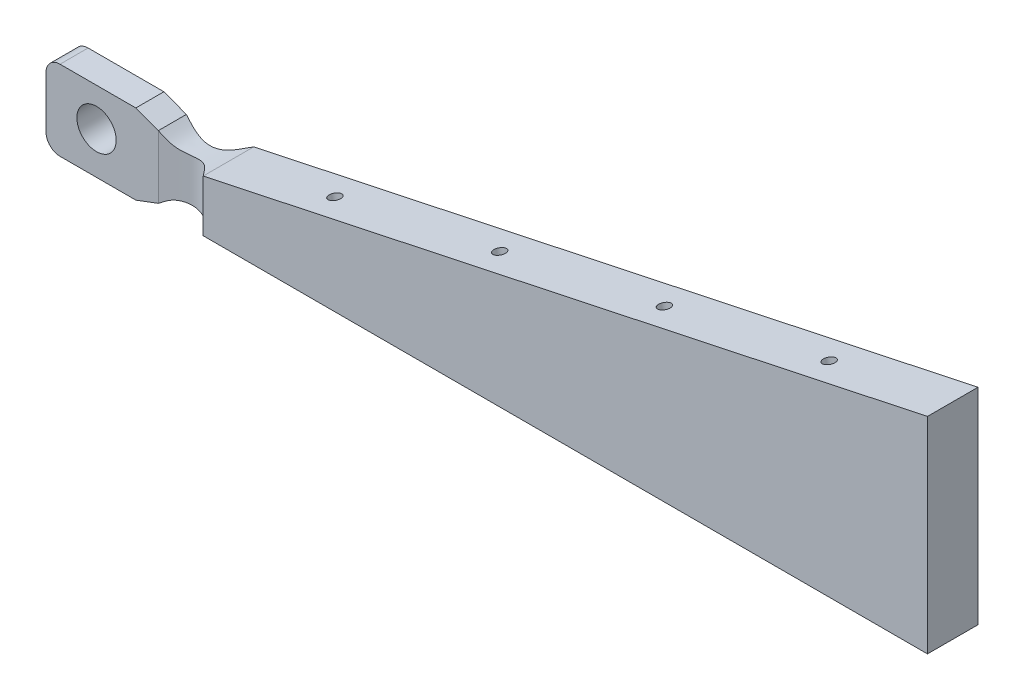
ISO-10303-21;
HEADER;
FILE_DESCRIPTION(('STEP AP214'),'2;1');
FILE_NAME('part.step','',(''),(''),'','','');
FILE_SCHEMA(('AUTOMOTIVE_DESIGN { 1 0 10303 214 1 1 1 1 }'));
ENDSEC;
DATA;
#1=APPLICATION_CONTEXT('core data for automotive mechanical design processes');
#2=APPLICATION_PROTOCOL_DEFINITION('international standard','automotive_design',2000,#1);
#3=PRODUCT_CONTEXT('',#1,'mechanical');
#4=PRODUCT('Part','Part','',(#3));
#5=PRODUCT_RELATED_PRODUCT_CATEGORY('part','',(#4));
#6=PRODUCT_DEFINITION_FORMATION('','',#4);
#7=PRODUCT_DEFINITION_CONTEXT('part definition',#1,'design');
#8=PRODUCT_DEFINITION('design','',#6,#7);
#9=PRODUCT_DEFINITION_SHAPE('','',#8);
#10=(LENGTH_UNIT() NAMED_UNIT(*) SI_UNIT(.MILLI.,.METRE.));
#11=(NAMED_UNIT(*) PLANE_ANGLE_UNIT() SI_UNIT($,.RADIAN.));
#12=(NAMED_UNIT(*) SI_UNIT($,.STERADIAN.) SOLID_ANGLE_UNIT());
#13=UNCERTAINTY_MEASURE_WITH_UNIT(LENGTH_MEASURE(1.E-05),#10,'distance_accuracy_value','');
#14=(GEOMETRIC_REPRESENTATION_CONTEXT(3) GLOBAL_UNCERTAINTY_ASSIGNED_CONTEXT((#13)) GLOBAL_UNIT_ASSIGNED_CONTEXT((#10,
#11,#12)) REPRESENTATION_CONTEXT('',''));
#15=CARTESIAN_POINT('',(0.,0.,0.));
#16=DIRECTION('',(0.,0.,1.));
#17=DIRECTION('',(1.,0.,0.));
#18=AXIS2_PLACEMENT_3D('',#15,#16,#17);
#19=CARTESIAN_POINT('',(-129.,0.,9.));
#20=DIRECTION('',(0.,1.,0.));
#21=DIRECTION('',(0.,0.,1.));
#22=AXIS2_PLACEMENT_3D('',#19,#20,#21);
#23=PLANE('',#22);
#24=CARTESIAN_POINT('',(-91.,0.,0.));
#25=DIRECTION('',(0.,-1.,0.));
#26=DIRECTION('',(0.,0.,-1.));
#27=AXIS2_PLACEMENT_3D('',#24,#25,#26);
#28=CIRCLE('',#27,2.09999999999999);
#29=CARTESIAN_POINT('',(-91.,0.,-2.09999999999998));
#30=VERTEX_POINT('',#29);
#31=EDGE_CURVE('E172',#30,#30,#28,.T.);
#32=ORIENTED_EDGE('',*,*,#31,.F.);
#33=EDGE_LOOP('',(#32));
#34=FACE_BOUND('',#33,.T.);
#35=CARTESIAN_POINT('',(-31.,0.,0.));
#36=DIRECTION('',(0.,-1.,0.));
#37=DIRECTION('',(0.,0.,-1.));
#38=AXIS2_PLACEMENT_3D('',#35,#36,#37);
#39=CIRCLE('',#38,2.09999999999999);
#40=CARTESIAN_POINT('',(-31.,0.,-2.09999999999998));
#41=VERTEX_POINT('',#40);
#42=EDGE_CURVE('E189',#41,#41,#39,.T.);
#43=ORIENTED_EDGE('',*,*,#42,.F.);
#44=EDGE_LOOP('',(#43));
#45=FACE_BOUND('',#44,.T.);
#46=CARTESIAN_POINT('',(29.,0.,0.));
#47=DIRECTION('',(0.,-1.,0.));
#48=DIRECTION('',(0.,0.,-1.));
#49=AXIS2_PLACEMENT_3D('',#46,#47,#48);
#50=CIRCLE('',#49,2.09999999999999);
#51=CARTESIAN_POINT('',(29.,0.,-2.09999999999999));
#52=VERTEX_POINT('',#51);
#53=EDGE_CURVE('E195',#52,#52,#50,.T.);
#54=ORIENTED_EDGE('',*,*,#53,.F.);
#55=EDGE_LOOP('',(#54));
#56=FACE_BOUND('',#55,.T.);
#57=CARTESIAN_POINT('',(89.,0.,0.));
#58=DIRECTION('',(0.,-1.,0.));
#59=DIRECTION('',(0.,0.,-1.));
#60=AXIS2_PLACEMENT_3D('',#57,#58,#59);
#61=CIRCLE('',#60,2.09999999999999);
#62=CARTESIAN_POINT('',(89.,0.,-2.09999999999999));
#63=VERTEX_POINT('',#62);
#64=EDGE_CURVE('E201',#63,#63,#61,.T.);
#65=ORIENTED_EDGE('',*,*,#64,.F.);
#66=EDGE_LOOP('',(#65));
#67=FACE_BOUND('',#66,.T.);
#68=DIRECTION('',(1.,0.,0.));
#69=VECTOR('',#68,1.);
#70=CARTESIAN_POINT('',(-129.,0.,-9.));
#71=LINE('',#70,#69);
#72=CARTESIAN_POINT('',(-129.,0.,-9.));
#73=VERTEX_POINT('',#72);
#74=CARTESIAN_POINT('',(129.,0.,-9.));
#75=VERTEX_POINT('',#74);
#76=EDGE_CURVE('E325',#73,#75,#71,.T.);
#77=ORIENTED_EDGE('',*,*,#76,.T.);
#78=DIRECTION('',(0.,0.,-1.));
#79=VECTOR('',#78,1.);
#80=CARTESIAN_POINT('',(129.,0.,9.));
#81=LINE('',#80,#79);
#82=CARTESIAN_POINT('',(129.,0.,9.));
#83=VERTEX_POINT('',#82);
#84=EDGE_CURVE('E345',#83,#75,#81,.T.);
#85=ORIENTED_EDGE('',*,*,#84,.F.);
#86=DIRECTION('',(1.,0.,0.));
#87=VECTOR('',#86,1.);
#88=CARTESIAN_POINT('',(-129.,0.,9.));
#89=LINE('',#88,#87);
#90=CARTESIAN_POINT('',(-129.,0.,9.));
#91=VERTEX_POINT('',#90);
#92=EDGE_CURVE('E334',#91,#83,#89,.T.);
#93=ORIENTED_EDGE('',*,*,#92,.F.);
#94=DIRECTION('',(0.,0.,-1.));
#95=VECTOR('',#94,1.);
#96=CARTESIAN_POINT('',(-129.,0.,9.));
#97=LINE('',#96,#95);
#98=EDGE_CURVE('E348',#91,#73,#97,.T.);
#99=ORIENTED_EDGE('',*,*,#98,.T.);
#100=EDGE_LOOP('',(#77,#85,#93,#99));
#101=FACE_BOUND('',#100,.T.);
#102=ADVANCED_FACE('F36',(#34,#45,#56,#67,#101),#23,.F.);
#103=CARTESIAN_POINT('',(129.,0.,9.));
#104=DIRECTION('',(-1.,0.,0.));
#105=DIRECTION('',(0.,0.,1.));
#106=AXIS2_PLACEMENT_3D('',#103,#104,#105);
#107=PLANE('',#106);
#108=DIRECTION('',(0.,1.,0.));
#109=VECTOR('',#108,1.);
#110=CARTESIAN_POINT('',(129.,0.,-9.));
#111=LINE('',#110,#109);
#112=CARTESIAN_POINT('',(129.,73.2753393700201,-9.));
#113=VERTEX_POINT('',#112);
#114=EDGE_CURVE('E327',#75,#113,#111,.T.);
#115=ORIENTED_EDGE('',*,*,#114,.T.);
#116=DIRECTION('',(0.,0.,-1.));
#117=VECTOR('',#116,1.);
#118=CARTESIAN_POINT('',(129.,73.2753393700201,9.));
#119=LINE('',#118,#117);
#120=CARTESIAN_POINT('',(129.,73.2753393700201,9.));
#121=VERTEX_POINT('',#120);
#122=EDGE_CURVE('E342',#121,#113,#119,.T.);
#123=ORIENTED_EDGE('',*,*,#122,.F.);
#124=DIRECTION('',(0.,1.,0.));
#125=VECTOR('',#124,1.);
#126=CARTESIAN_POINT('',(129.,0.,9.));
#127=LINE('',#126,#125);
#128=EDGE_CURVE('E336',#83,#121,#127,.T.);
#129=ORIENTED_EDGE('',*,*,#128,.F.);
#130=ORIENTED_EDGE('',*,*,#84,.T.);
#131=EDGE_LOOP('',(#115,#123,#129,#130));
#132=FACE_BOUND('',#131,.T.);
#133=ADVANCED_FACE('F393',(#132),#107,.F.);
#134=CARTESIAN_POINT('',(129.,73.2753393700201,9.));
#135=DIRECTION('',(0.207911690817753,-0.978147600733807,0.));
#136=DIRECTION('',(0.978147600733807,0.207911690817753,0.));
#137=AXIS2_PLACEMENT_3D('',#134,#135,#136);
#138=PLANE('',#137);
#139=CARTESIAN_POINT('',(-91.0832101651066,26.4952089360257,0.));
#140=DIRECTION('',(-0.207911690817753,0.978147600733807,0.));
#141=DIRECTION('',(-0.978147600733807,-0.207911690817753,0.));
#142=AXIS2_PLACEMENT_3D('',#139,#140,#141);
#143=CIRCLE('',#142,2.09999999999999);
#144=CARTESIAN_POINT('',(-93.1373201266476,26.0585943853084,0.));
#145=VERTEX_POINT('',#144);
#146=EDGE_CURVE('E205',#145,#145,#143,.T.);
#147=ORIENTED_EDGE('',*,*,#146,.F.);
#148=EDGE_LOOP('',(#147));
#149=FACE_BOUND('',#148,.T.);
#150=CARTESIAN_POINT('',(-32.3943541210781,38.9699103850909,0.));
#151=DIRECTION('',(-0.207911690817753,0.978147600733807,0.));
#152=DIRECTION('',(-0.978147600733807,-0.207911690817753,0.));
#153=AXIS2_PLACEMENT_3D('',#150,#151,#152);
#154=CIRCLE('',#153,2.09999999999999);
#155=CARTESIAN_POINT('',(-34.4484640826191,38.5332958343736,0.));
#156=VERTEX_POINT('',#155);
#157=EDGE_CURVE('E211',#156,#156,#154,.T.);
#158=ORIENTED_EDGE('',*,*,#157,.F.);
#159=EDGE_LOOP('',(#158));
#160=FACE_BOUND('',#159,.T.);
#161=CARTESIAN_POINT('',(26.2945019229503,51.4446118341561,0.));
#162=DIRECTION('',(-0.207911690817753,0.978147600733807,0.));
#163=DIRECTION('',(-0.978147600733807,-0.207911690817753,0.));
#164=AXIS2_PLACEMENT_3D('',#161,#162,#163);
#165=CIRCLE('',#164,2.09999999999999);
#166=CARTESIAN_POINT('',(24.2403919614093,51.0079972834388,0.));
#167=VERTEX_POINT('',#166);
#168=EDGE_CURVE('E217',#167,#167,#165,.T.);
#169=ORIENTED_EDGE('',*,*,#168,.F.);
#170=EDGE_LOOP('',(#169));
#171=FACE_BOUND('',#170,.T.);
#172=CARTESIAN_POINT('',(84.9833579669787,63.9193132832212,0.));
#173=DIRECTION('',(-0.207911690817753,0.978147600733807,0.));
#174=DIRECTION('',(-0.978147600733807,-0.207911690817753,0.));
#175=AXIS2_PLACEMENT_3D('',#172,#173,#174);
#176=CIRCLE('',#175,2.09999999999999);
#177=CARTESIAN_POINT('',(82.9292480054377,63.4826987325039,0.));
#178=VERTEX_POINT('',#177);
#179=EDGE_CURVE('E223',#178,#178,#176,.T.);
#180=ORIENTED_EDGE('',*,*,#179,.F.);
#181=EDGE_LOOP('',(#180));
#182=FACE_BOUND('',#181,.T.);
#183=DIRECTION('',(-0.978147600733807,-0.207911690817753,0.));
#184=VECTOR('',#183,1.);
#185=CARTESIAN_POINT('',(129.,73.2753393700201,-9.));
#186=LINE('',#185,#184);
#187=CARTESIAN_POINT('',(-129.,18.4357464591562,-9.));
#188=VERTEX_POINT('',#187);
#189=EDGE_CURVE('E329',#113,#188,#186,.T.);
#190=ORIENTED_EDGE('',*,*,#189,.T.);
#191=DIRECTION('',(0.,0.,-1.));
#192=VECTOR('',#191,1.);
#193=CARTESIAN_POINT('',(-129.,18.4357464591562,9.));
#194=LINE('',#193,#192);
#195=CARTESIAN_POINT('',(-129.,18.4357464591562,9.));
#196=VERTEX_POINT('',#195);
#197=EDGE_CURVE('E339',#196,#188,#194,.T.);
#198=ORIENTED_EDGE('',*,*,#197,.F.);
#199=DIRECTION('',(-0.978147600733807,-0.207911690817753,0.));
#200=VECTOR('',#199,1.);
#201=CARTESIAN_POINT('',(129.,73.2753393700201,9.));
#202=LINE('',#201,#200);
#203=EDGE_CURVE('E63',#121,#196,#202,.T.);
#204=ORIENTED_EDGE('',*,*,#203,.F.);
#205=ORIENTED_EDGE('',*,*,#122,.T.);
#206=EDGE_LOOP('',(#190,#198,#204,#205));
#207=FACE_BOUND('',#206,.T.);
#208=ADVANCED_FACE('F398',(#149,#160,#171,#182,#207),#138,.F.);
#209=CARTESIAN_POINT('',(-129.,0.,9.));
#210=DIRECTION('',(0.,0.,1.));
#211=DIRECTION('',(1.,0.,0.));
#212=AXIS2_PLACEMENT_3D('',#209,#210,#211);
#213=PLANE('',#212);
#214=DIRECTION('',(0.,-1.,0.));
#215=VECTOR('',#214,1.);
#216=CARTESIAN_POINT('',(-129.,18.4357464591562,9.));
#217=LINE('',#216,#215);
#218=EDGE_CURVE('E332',#196,#91,#217,.T.);
#219=ORIENTED_EDGE('',*,*,#218,.T.);
#220=ORIENTED_EDGE('',*,*,#92,.T.);
#221=ORIENTED_EDGE('',*,*,#128,.T.);
#222=ORIENTED_EDGE('',*,*,#203,.T.);
#223=EDGE_LOOP('',(#219,#220,#221,#222));
#224=FACE_BOUND('',#223,.T.);
#225=ADVANCED_FACE('F466',(#224),#213,.T.);
#226=CARTESIAN_POINT('',(-129.,0.,-9.));
#227=DIRECTION('',(0.,0.,1.));
#228=DIRECTION('',(1.,0.,0.));
#229=AXIS2_PLACEMENT_3D('',#226,#227,#228);
#230=PLANE('',#229);
#231=DIRECTION('',(0.,-1.,0.));
#232=VECTOR('',#231,1.);
#233=CARTESIAN_POINT('',(-129.,18.4357464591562,-9.));
#234=LINE('',#233,#232);
#235=EDGE_CURVE('E312',#188,#73,#234,.T.);
#236=ORIENTED_EDGE('',*,*,#235,.F.);
#237=ORIENTED_EDGE('',*,*,#189,.F.);
#238=ORIENTED_EDGE('',*,*,#114,.F.);
#239=ORIENTED_EDGE('',*,*,#76,.F.);
#240=EDGE_LOOP('',(#236,#237,#238,#239));
#241=FACE_BOUND('',#240,.T.);
#242=ADVANCED_FACE('F415',(#241),#230,.F.);
#243=CARTESIAN_POINT('',(-129.,0.,9.));
#244=CARTESIAN_POINT('',(-130.529516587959,0.325187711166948,6.99359475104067));
#245=CARTESIAN_POINT('',(-134.371844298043,1.14209794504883,1.95326596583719));
#246=CARTESIAN_POINT('',(-143.016239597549,2.44586244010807,3.82163658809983));
#247=CARTESIAN_POINT('',(-147.40743275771,-0.816741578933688,4.68638066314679));
#248=CARTESIAN_POINT('',(-149.,-2.,5.));
#249=CARTESIAN_POINT('',(-129.,18.4357464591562,9.));
#250=CARTESIAN_POINT('',(-130.529516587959,18.1105587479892,6.99359475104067));
#251=CARTESIAN_POINT('',(-134.371844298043,17.2936485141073,1.95326596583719));
#252=CARTESIAN_POINT('',(-143.016239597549,15.9898840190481,3.82163658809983));
#253=CARTESIAN_POINT('',(-147.40743275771,19.2524880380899,4.68638066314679));
#254=CARTESIAN_POINT('',(-149.,20.4357464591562,5.));
#255=B_SPLINE_SURFACE_WITH_KNOTS('',1,3,((#243,#244,#245,#246,#247,#248),(#249,#250,#251,#252,
#253,#254)),.UNSPECIFIED.,.F.,.F.,.F.,(2,2),(4,1,1,4),(0.,1.),(0.,0.296507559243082,
0.744862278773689,1.),.UNSPECIFIED.);
#256=CARTESIAN_POINT('',(-129.,18.4357464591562,9.));
#257=CARTESIAN_POINT('',(-130.529516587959,18.1105587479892,6.99359475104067));
#258=CARTESIAN_POINT('',(-134.371844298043,17.2936485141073,1.95326596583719));
#259=CARTESIAN_POINT('',(-143.016239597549,15.9898840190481,3.82163658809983));
#260=CARTESIAN_POINT('',(-147.40743275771,19.2524880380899,4.68638066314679));
#261=CARTESIAN_POINT('',(-149.,20.4357464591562,5.));
#262=B_SPLINE_CURVE_WITH_KNOTS('',3,(#256,#257,#258,#259,#260,#261),.UNSPECIFIED.,.F.,.F.,(4,1,
1,4),(0.,0.296507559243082,0.744862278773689,1.),.UNSPECIFIED.);
#263=CARTESIAN_POINT('',(-149.,20.4357464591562,5.));
#264=VERTEX_POINT('',#263);
#265=EDGE_CURVE('E304',#196,#264,#262,.T.);
#266=DIRECTION('',(0.,-1.,0.));
#267=VECTOR('',#266,1.);
#268=CARTESIAN_POINT('',(-149.,20.4357464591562,5.));
#269=LINE('',#268,#267);
#270=CARTESIAN_POINT('',(-149.,-2.,5.));
#271=VERTEX_POINT('',#270);
#272=EDGE_CURVE('E285',#264,#271,#269,.T.);
#273=CARTESIAN_POINT('',(-129.,0.,9.));
#274=CARTESIAN_POINT('',(-130.529516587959,0.325187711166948,6.99359475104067));
#275=CARTESIAN_POINT('',(-134.371844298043,1.14209794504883,1.95326596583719));
#276=CARTESIAN_POINT('',(-143.016239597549,2.44586244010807,3.82163658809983));
#277=CARTESIAN_POINT('',(-147.40743275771,-0.816741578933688,4.68638066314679));
#278=CARTESIAN_POINT('',(-149.,-2.,5.));
#279=B_SPLINE_CURVE_WITH_KNOTS('',3,(#273,#274,#275,#276,#277,#278),.UNSPECIFIED.,.F.,.F.,(4,1,
1,4),(0.,0.296507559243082,0.744862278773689,1.),.UNSPECIFIED.);
#280=EDGE_CURVE('E303',#271,#91,#279,.F.);
#281=ORIENTED_EDGE('',*,*,#218,.F.);
#282=ORIENTED_EDGE('',*,*,#265,.T.);
#283=ORIENTED_EDGE('',*,*,#272,.T.);
#284=ORIENTED_EDGE('',*,*,#280,.T.);
#285=EDGE_LOOP('',(#281,#282,#283,#284));
#286=FACE_BOUND('',#285,.T.);
#287=ADVANCED_FACE('F465',(#286),#255,.T.);
#288=CARTESIAN_POINT('',(-129.,18.4357464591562,9.));
#289=CARTESIAN_POINT('',(-130.529516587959,18.1105587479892,6.99359475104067));
#290=CARTESIAN_POINT('',(-134.371844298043,17.2936485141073,1.95326596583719));
#291=CARTESIAN_POINT('',(-143.016239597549,15.9898840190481,3.82163658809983));
#292=CARTESIAN_POINT('',(-147.40743275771,19.2524880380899,4.68638066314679));
#293=CARTESIAN_POINT('',(-149.,20.4357464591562,5.));
#294=CARTESIAN_POINT('',(-129.,18.4357464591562,-9.));
#295=CARTESIAN_POINT('',(-130.529516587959,18.1105587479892,-6.99359475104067));
#296=CARTESIAN_POINT('',(-134.371844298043,17.2936485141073,-1.95326596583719));
#297=CARTESIAN_POINT('',(-143.016239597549,15.9898840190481,-3.82163658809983));
#298=CARTESIAN_POINT('',(-147.40743275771,19.2524880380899,-4.68638066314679));
#299=CARTESIAN_POINT('',(-149.,20.4357464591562,-5.));
#300=B_SPLINE_SURFACE_WITH_KNOTS('',1,3,((#288,#289,#290,#291,#292,#293),(#294,#295,#296,#297,
#298,#299)),.UNSPECIFIED.,.F.,.F.,.F.,(2,2),(4,1,1,4),(0.,1.),(0.,0.296507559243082,
0.744862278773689,1.),.UNSPECIFIED.);
#301=CARTESIAN_POINT('',(-129.,18.4357464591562,-9.));
#302=CARTESIAN_POINT('',(-130.529516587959,18.1105587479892,-6.99359475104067));
#303=CARTESIAN_POINT('',(-134.371844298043,17.2936485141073,-1.95326596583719));
#304=CARTESIAN_POINT('',(-143.016239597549,15.9898840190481,-3.82163658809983));
#305=CARTESIAN_POINT('',(-147.40743275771,19.2524880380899,-4.68638066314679));
#306=CARTESIAN_POINT('',(-149.,20.4357464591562,-5.));
#307=B_SPLINE_CURVE_WITH_KNOTS('',3,(#301,#302,#303,#304,#305,#306),.UNSPECIFIED.,.F.,.F.,(4,1,
1,4),(0.,0.296507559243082,0.744862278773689,1.),.UNSPECIFIED.);
#308=CARTESIAN_POINT('',(-149.,20.4357464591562,-5.));
#309=VERTEX_POINT('',#308);
#310=EDGE_CURVE('E295',#188,#309,#307,.T.);
#311=DIRECTION('',(0.,0.,1.));
#312=VECTOR('',#311,1.);
#313=CARTESIAN_POINT('',(-149.,20.4357464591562,-5.));
#314=LINE('',#313,#312);
#315=EDGE_CURVE('E282',#309,#264,#314,.T.);
#316=ORIENTED_EDGE('',*,*,#197,.T.);
#317=ORIENTED_EDGE('',*,*,#310,.T.);
#318=ORIENTED_EDGE('',*,*,#315,.T.);
#319=ORIENTED_EDGE('',*,*,#265,.F.);
#320=EDGE_LOOP('',(#316,#317,#318,#319));
#321=FACE_BOUND('',#320,.T.);
#322=ADVANCED_FACE('F420',(#321),#300,.T.);
#323=CARTESIAN_POINT('',(-129.,0.,-9.));
#324=CARTESIAN_POINT('',(-130.529516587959,0.325187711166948,-6.99359475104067));
#325=CARTESIAN_POINT('',(-134.371844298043,1.14209794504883,-1.95326596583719));
#326=CARTESIAN_POINT('',(-143.016239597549,2.44586244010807,-3.82163658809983));
#327=CARTESIAN_POINT('',(-147.40743275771,-0.816741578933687,-4.68638066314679));
#328=CARTESIAN_POINT('',(-149.,-2.,-5.));
#329=CARTESIAN_POINT('',(-129.,0.,9.));
#330=CARTESIAN_POINT('',(-130.529516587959,0.325187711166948,6.99359475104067));
#331=CARTESIAN_POINT('',(-134.371844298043,1.14209794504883,1.95326596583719));
#332=CARTESIAN_POINT('',(-143.016239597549,2.44586244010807,3.82163658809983));
#333=CARTESIAN_POINT('',(-147.40743275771,-0.816741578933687,4.68638066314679));
#334=CARTESIAN_POINT('',(-149.,-2.,5.));
#335=B_SPLINE_SURFACE_WITH_KNOTS('',1,3,((#323,#324,#325,#326,#327,#328),(#329,#330,#331,#332,
#333,#334)),.UNSPECIFIED.,.F.,.F.,.F.,(2,2),(4,1,1,4),(0.,1.),(0.,0.296507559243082,
0.744862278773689,1.),.UNSPECIFIED.);
#336=DIRECTION('',(0.,0.,-1.));
#337=VECTOR('',#336,1.);
#338=CARTESIAN_POINT('',(-149.,-2.,5.));
#339=LINE('',#338,#337);
#340=CARTESIAN_POINT('',(-149.,-2.,-5.));
#341=VERTEX_POINT('',#340);
#342=EDGE_CURVE('E278',#271,#341,#339,.T.);
#343=CARTESIAN_POINT('',(-129.,0.,-9.));
#344=CARTESIAN_POINT('',(-130.529516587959,0.325187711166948,-6.99359475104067));
#345=CARTESIAN_POINT('',(-134.371844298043,1.14209794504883,-1.95326596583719));
#346=CARTESIAN_POINT('',(-143.016239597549,2.44586244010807,-3.82163658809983));
#347=CARTESIAN_POINT('',(-147.40743275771,-0.816741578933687,-4.68638066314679));
#348=CARTESIAN_POINT('',(-149.,-2.,-5.));
#349=B_SPLINE_CURVE_WITH_KNOTS('',3,(#343,#344,#345,#346,#347,#348),.UNSPECIFIED.,.F.,.F.,(4,1,
1,4),(0.,0.296507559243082,0.744862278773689,1.),.UNSPECIFIED.);
#350=EDGE_CURVE('E288',#73,#341,#349,.T.);
#351=ORIENTED_EDGE('',*,*,#98,.F.);
#352=ORIENTED_EDGE('',*,*,#280,.F.);
#353=ORIENTED_EDGE('',*,*,#342,.T.);
#354=ORIENTED_EDGE('',*,*,#350,.F.);
#355=EDGE_LOOP('',(#351,#352,#353,#354));
#356=FACE_BOUND('',#355,.T.);
#357=ADVANCED_FACE('F436',(#356),#335,.T.);
#358=CARTESIAN_POINT('',(-129.,18.4357464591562,-9.));
#359=CARTESIAN_POINT('',(-130.529516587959,18.1105587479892,-6.99359475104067));
#360=CARTESIAN_POINT('',(-134.371844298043,17.2936485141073,-1.95326596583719));
#361=CARTESIAN_POINT('',(-143.016239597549,15.9898840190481,-3.82163658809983));
#362=CARTESIAN_POINT('',(-147.40743275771,19.2524880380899,-4.68638066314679));
#363=CARTESIAN_POINT('',(-149.,20.4357464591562,-5.));
#364=CARTESIAN_POINT('',(-129.,0.,-9.));
#365=CARTESIAN_POINT('',(-130.529516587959,0.325187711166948,-6.99359475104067));
#366=CARTESIAN_POINT('',(-134.371844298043,1.14209794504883,-1.95326596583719));
#367=CARTESIAN_POINT('',(-143.016239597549,2.44586244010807,-3.82163658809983));
#368=CARTESIAN_POINT('',(-147.40743275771,-0.816741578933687,-4.68638066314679));
#369=CARTESIAN_POINT('',(-149.,-2.,-5.));
#370=B_SPLINE_SURFACE_WITH_KNOTS('',1,3,((#358,#359,#360,#361,#362,#363),(#364,#365,#366,#367,
#368,#369)),.UNSPECIFIED.,.F.,.F.,.F.,(2,2),(4,1,1,4),(0.,1.),(0.,0.296507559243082,
0.744862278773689,1.),.UNSPECIFIED.);
#371=DIRECTION('',(0.,1.,0.));
#372=VECTOR('',#371,1.);
#373=CARTESIAN_POINT('',(-149.,-2.,-5.));
#374=LINE('',#373,#372);
#375=EDGE_CURVE('E279',#341,#309,#374,.T.);
#376=ORIENTED_EDGE('',*,*,#235,.T.);
#377=ORIENTED_EDGE('',*,*,#350,.T.);
#378=ORIENTED_EDGE('',*,*,#375,.T.);
#379=ORIENTED_EDGE('',*,*,#310,.F.);
#380=EDGE_LOOP('',(#376,#377,#378,#379));
#381=FACE_BOUND('',#380,.T.);
#382=ADVANCED_FACE('F423',(#381),#370,.T.);
#383=CARTESIAN_POINT('',(-184.,18.4357464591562,5.));
#384=DIRECTION('',(0.,0.,-1.));
#385=DIRECTION('',(-1.,0.,0.));
#386=AXIS2_PLACEMENT_3D('',#383,#384,#385);
#387=CYLINDRICAL_SURFACE('',#386,5.);
#388=CARTESIAN_POINT('',(-184.,18.4357464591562,-5.));
#389=DIRECTION('',(0.,0.,1.));
#390=DIRECTION('',(1.,0.,0.));
#391=AXIS2_PLACEMENT_3D('',#388,#389,#390);
#392=CIRCLE('',#391,5.);
#393=CARTESIAN_POINT('',(-184.,23.4357464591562,-5.));
#394=VERTEX_POINT('',#393);
#395=CARTESIAN_POINT('',(-189.,18.4357464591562,-5.));
#396=VERTEX_POINT('',#395);
#397=EDGE_CURVE('E230',#394,#396,#392,.T.);
#398=ORIENTED_EDGE('',*,*,#397,.T.);
#399=DIRECTION('',(0.,0.,-1.));
#400=VECTOR('',#399,1.);
#401=CARTESIAN_POINT('',(-189.,18.4357464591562,5.));
#402=LINE('',#401,#400);
#403=CARTESIAN_POINT('',(-189.,18.4357464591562,5.));
#404=VERTEX_POINT('',#403);
#405=EDGE_CURVE('E275',#404,#396,#402,.T.);
#406=ORIENTED_EDGE('',*,*,#405,.F.);
#407=CARTESIAN_POINT('',(-184.,18.4357464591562,5.));
#408=DIRECTION('',(0.,0.,1.));
#409=DIRECTION('',(1.,0.,0.));
#410=AXIS2_PLACEMENT_3D('',#407,#408,#409);
#411=CIRCLE('',#410,5.);
#412=CARTESIAN_POINT('',(-184.,23.4357464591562,5.));
#413=VERTEX_POINT('',#412);
#414=EDGE_CURVE('E245',#413,#404,#411,.T.);
#415=ORIENTED_EDGE('',*,*,#414,.F.);
#416=DIRECTION('',(0.,0.,-1.));
#417=VECTOR('',#416,1.);
#418=CARTESIAN_POINT('',(-184.,23.4357464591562,5.));
#419=LINE('',#418,#417);
#420=EDGE_CURVE('E260',#413,#394,#419,.T.);
#421=ORIENTED_EDGE('',*,*,#420,.T.);
#422=EDGE_LOOP('',(#398,#406,#415,#421));
#423=FACE_BOUND('',#422,.T.);
#424=ADVANCED_FACE('F455',(#423),#387,.T.);
#425=CARTESIAN_POINT('',(-189.,18.4357464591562,5.));
#426=DIRECTION('',(1.,0.,0.));
#427=DIRECTION('',(0.,0.,-1.));
#428=AXIS2_PLACEMENT_3D('',#425,#426,#427);
#429=PLANE('',#428);
#430=DIRECTION('',(0.,-1.,0.));
#431=VECTOR('',#430,1.);
#432=CARTESIAN_POINT('',(-189.,18.4357464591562,-5.));
#433=LINE('',#432,#431);
#434=CARTESIAN_POINT('',(-189.,0.,-5.));
#435=VERTEX_POINT('',#434);
#436=EDGE_CURVE('E233',#396,#435,#433,.T.);
#437=ORIENTED_EDGE('',*,*,#436,.T.);
#438=DIRECTION('',(0.,0.,-1.));
#439=VECTOR('',#438,1.);
#440=CARTESIAN_POINT('',(-189.,0.,5.));
#441=LINE('',#440,#439);
#442=CARTESIAN_POINT('',(-189.,0.,5.));
#443=VERTEX_POINT('',#442);
#444=EDGE_CURVE('E272',#443,#435,#441,.T.);
#445=ORIENTED_EDGE('',*,*,#444,.F.);
#446=DIRECTION('',(0.,-1.,0.));
#447=VECTOR('',#446,1.);
#448=CARTESIAN_POINT('',(-189.,18.4357464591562,5.));
#449=LINE('',#448,#447);
#450=EDGE_CURVE('E248',#404,#443,#449,.T.);
#451=ORIENTED_EDGE('',*,*,#450,.F.);
#452=ORIENTED_EDGE('',*,*,#405,.T.);
#453=EDGE_LOOP('',(#437,#445,#451,#452));
#454=FACE_BOUND('',#453,.T.);
#455=ADVANCED_FACE('F451',(#454),#429,.F.);
#456=CARTESIAN_POINT('',(-184.,0.,5.));
#457=DIRECTION('',(0.,0.,-1.));
#458=DIRECTION('',(-1.,0.,0.));
#459=AXIS2_PLACEMENT_3D('',#456,#457,#458);
#460=CYLINDRICAL_SURFACE('',#459,5.);
#461=CARTESIAN_POINT('',(-184.,0.,-5.));
#462=DIRECTION('',(0.,0.,1.));
#463=DIRECTION('',(1.,0.,0.));
#464=AXIS2_PLACEMENT_3D('',#461,#462,#463);
#465=CIRCLE('',#464,5.);
#466=CARTESIAN_POINT('',(-184.,-5.,-5.));
#467=VERTEX_POINT('',#466);
#468=EDGE_CURVE('E235',#435,#467,#465,.T.);
#469=ORIENTED_EDGE('',*,*,#468,.T.);
#470=DIRECTION('',(0.,0.,-1.));
#471=VECTOR('',#470,1.);
#472=CARTESIAN_POINT('',(-184.,-5.,5.));
#473=LINE('',#472,#471);
#474=CARTESIAN_POINT('',(-184.,-5.,5.));
#475=VERTEX_POINT('',#474);
#476=EDGE_CURVE('E269',#475,#467,#473,.T.);
#477=ORIENTED_EDGE('',*,*,#476,.F.);
#478=CARTESIAN_POINT('',(-184.,0.,5.));
#479=DIRECTION('',(0.,0.,1.));
#480=DIRECTION('',(1.,0.,0.));
#481=AXIS2_PLACEMENT_3D('',#478,#479,#480);
#482=CIRCLE('',#481,5.);
#483=EDGE_CURVE('E250',#443,#475,#482,.T.);
#484=ORIENTED_EDGE('',*,*,#483,.F.);
#485=ORIENTED_EDGE('',*,*,#444,.T.);
#486=EDGE_LOOP('',(#469,#477,#484,#485));
#487=FACE_BOUND('',#486,.T.);
#488=ADVANCED_FACE('F447',(#487),#460,.T.);
#489=CARTESIAN_POINT('',(-184.,-5.,5.));
#490=DIRECTION('',(0.,1.,0.));
#491=DIRECTION('',(-1.,0.,0.));
#492=AXIS2_PLACEMENT_3D('',#489,#490,#491);
#493=PLANE('',#492);
#494=DIRECTION('',(1.,0.,0.));
#495=VECTOR('',#494,1.);
#496=CARTESIAN_POINT('',(-184.,-5.,-5.));
#497=LINE('',#496,#495);
#498=CARTESIAN_POINT('',(-157.,-5.,-5.));
#499=VERTEX_POINT('',#498);
#500=EDGE_CURVE('E237',#467,#499,#497,.T.);
#501=ORIENTED_EDGE('',*,*,#500,.T.);
#502=DIRECTION('',(0.,0.,-1.));
#503=VECTOR('',#502,1.);
#504=CARTESIAN_POINT('',(-157.,-5.,5.));
#505=LINE('',#504,#503);
#506=CARTESIAN_POINT('',(-157.,-5.,5.));
#507=VERTEX_POINT('',#506);
#508=EDGE_CURVE('E266',#507,#499,#505,.T.);
#509=ORIENTED_EDGE('',*,*,#508,.F.);
#510=DIRECTION('',(1.,0.,0.));
#511=VECTOR('',#510,1.);
#512=CARTESIAN_POINT('',(-184.,-5.,5.));
#513=LINE('',#512,#511);
#514=EDGE_CURVE('E252',#475,#507,#513,.T.);
#515=ORIENTED_EDGE('',*,*,#514,.F.);
#516=ORIENTED_EDGE('',*,*,#476,.T.);
#517=EDGE_LOOP('',(#501,#509,#515,#516));
#518=FACE_BOUND('',#517,.T.);
#519=ADVANCED_FACE('F443',(#518),#493,.F.);
#520=CARTESIAN_POINT('',(-149.,-2.,5.));
#521=DIRECTION('',(-0.351123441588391,0.936329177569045,0.));
#522=DIRECTION('',(-0.936329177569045,-0.351123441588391,0.));
#523=AXIS2_PLACEMENT_3D('',#520,#521,#522);
#524=PLANE('',#523);
#525=DIRECTION('',(0.936329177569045,0.351123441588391,0.));
#526=VECTOR('',#525,1.);
#527=CARTESIAN_POINT('',(-149.,-2.,-5.));
#528=LINE('',#527,#526);
#529=EDGE_CURVE('E239',#499,#341,#528,.T.);
#530=ORIENTED_EDGE('',*,*,#529,.T.);
#531=ORIENTED_EDGE('',*,*,#342,.F.);
#532=DIRECTION('',(0.936329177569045,0.351123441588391,0.));
#533=VECTOR('',#532,1.);
#534=CARTESIAN_POINT('',(-149.,-2.,5.));
#535=LINE('',#534,#533);
#536=EDGE_CURVE('E254',#507,#271,#535,.T.);
#537=ORIENTED_EDGE('',*,*,#536,.F.);
#538=ORIENTED_EDGE('',*,*,#508,.T.);
#539=EDGE_LOOP('',(#530,#531,#537,#538));
#540=FACE_BOUND('',#539,.T.);
#541=ADVANCED_FACE('F439',(#540),#524,.F.);
#542=CARTESIAN_POINT('',(-149.,20.4357464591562,5.));
#543=DIRECTION('',(-0.351123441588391,-0.936329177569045,0.));
#544=DIRECTION('',(0.936329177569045,-0.351123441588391,0.));
#545=AXIS2_PLACEMENT_3D('',#542,#543,#544);
#546=PLANE('',#545);
#547=DIRECTION('',(-0.936329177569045,0.351123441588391,0.));
#548=VECTOR('',#547,1.);
#549=CARTESIAN_POINT('',(-149.,20.4357464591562,-5.));
#550=LINE('',#549,#548);
#551=CARTESIAN_POINT('',(-157.,23.4357464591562,-5.));
#552=VERTEX_POINT('',#551);
#553=EDGE_CURVE('E241',#309,#552,#550,.T.);
#554=ORIENTED_EDGE('',*,*,#553,.T.);
#555=DIRECTION('',(0.,0.,-1.));
#556=VECTOR('',#555,1.);
#557=CARTESIAN_POINT('',(-157.,23.4357464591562,5.));
#558=LINE('',#557,#556);
#559=CARTESIAN_POINT('',(-157.,23.4357464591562,5.));
#560=VERTEX_POINT('',#559);
#561=EDGE_CURVE('E263',#560,#552,#558,.T.);
#562=ORIENTED_EDGE('',*,*,#561,.F.);
#563=DIRECTION('',(-0.936329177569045,0.351123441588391,0.));
#564=VECTOR('',#563,1.);
#565=CARTESIAN_POINT('',(-149.,20.4357464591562,5.));
#566=LINE('',#565,#564);
#567=EDGE_CURVE('E256',#264,#560,#566,.T.);
#568=ORIENTED_EDGE('',*,*,#567,.F.);
#569=ORIENTED_EDGE('',*,*,#315,.F.);
#570=EDGE_LOOP('',(#554,#562,#568,#569));
#571=FACE_BOUND('',#570,.T.);
#572=ADVANCED_FACE('F463',(#571),#546,.F.);
#573=CARTESIAN_POINT('',(-184.,23.4357464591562,5.));
#574=DIRECTION('',(0.,-1.,0.));
#575=DIRECTION('',(0.,0.,-1.));
#576=AXIS2_PLACEMENT_3D('',#573,#574,#575);
#577=PLANE('',#576);
#578=DIRECTION('',(-1.,0.,0.));
#579=VECTOR('',#578,1.);
#580=CARTESIAN_POINT('',(-184.,23.4357464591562,-5.));
#581=LINE('',#580,#579);
#582=EDGE_CURVE('E243',#552,#394,#581,.T.);
#583=ORIENTED_EDGE('',*,*,#582,.T.);
#584=ORIENTED_EDGE('',*,*,#420,.F.);
#585=DIRECTION('',(-1.,0.,0.));
#586=VECTOR('',#585,1.);
#587=CARTESIAN_POINT('',(-184.,23.4357464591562,5.));
#588=LINE('',#587,#586);
#589=EDGE_CURVE('E258',#560,#413,#588,.T.);
#590=ORIENTED_EDGE('',*,*,#589,.F.);
#591=ORIENTED_EDGE('',*,*,#561,.T.);
#592=EDGE_LOOP('',(#583,#584,#590,#591));
#593=FACE_BOUND('',#592,.T.);
#594=ADVANCED_FACE('F458',(#593),#577,.F.);
#595=CARTESIAN_POINT('',(-184.,18.4357464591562,5.));
#596=DIRECTION('',(0.,0.,1.));
#597=DIRECTION('',(1.,0.,0.));
#598=AXIS2_PLACEMENT_3D('',#595,#596,#597);
#599=PLANE('',#598);
#600=CARTESIAN_POINT('',(-171.,9.93574645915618,5.));
#601=DIRECTION('',(0.,0.,1.));
#602=DIRECTION('',(1.,0.,0.));
#603=AXIS2_PLACEMENT_3D('',#600,#601,#602);
#604=CIRCLE('',#603,7.00000000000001);
#605=CARTESIAN_POINT('',(-164.,9.93574645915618,5.));
#606=VERTEX_POINT('',#605);
#607=EDGE_CURVE('E226',#606,#606,#604,.T.);
#608=ORIENTED_EDGE('',*,*,#607,.F.);
#609=EDGE_LOOP('',(#608));
#610=FACE_BOUND('',#609,.T.);
#611=ORIENTED_EDGE('',*,*,#414,.T.);
#612=ORIENTED_EDGE('',*,*,#450,.T.);
#613=ORIENTED_EDGE('',*,*,#483,.T.);
#614=ORIENTED_EDGE('',*,*,#514,.T.);
#615=ORIENTED_EDGE('',*,*,#536,.T.);
#616=ORIENTED_EDGE('',*,*,#272,.F.);
#617=ORIENTED_EDGE('',*,*,#567,.T.);
#618=ORIENTED_EDGE('',*,*,#589,.T.);
#619=EDGE_LOOP('',(#611,#612,#613,#614,#615,#616,#617,#618));
#620=FACE_BOUND('',#619,.T.);
#621=ADVANCED_FACE('F527',(#610,#620),#599,.T.);
#622=CARTESIAN_POINT('',(-184.,18.4357464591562,-5.));
#623=DIRECTION('',(0.,0.,1.));
#624=DIRECTION('',(1.,0.,0.));
#625=AXIS2_PLACEMENT_3D('',#622,#623,#624);
#626=PLANE('',#625);
#627=CARTESIAN_POINT('',(-171.,9.93574645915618,-5.));
#628=DIRECTION('',(0.,0.,1.));
#629=DIRECTION('',(1.,0.,0.));
#630=AXIS2_PLACEMENT_3D('',#627,#628,#629);
#631=CIRCLE('',#630,7.00000000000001);
#632=CARTESIAN_POINT('',(-164.,9.93574645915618,-5.));
#633=VERTEX_POINT('',#632);
#634=EDGE_CURVE('E229',#633,#633,#631,.T.);
#635=ORIENTED_EDGE('',*,*,#634,.T.);
#636=EDGE_LOOP('',(#635));
#637=FACE_BOUND('',#636,.T.);
#638=ORIENTED_EDGE('',*,*,#397,.F.);
#639=ORIENTED_EDGE('',*,*,#582,.F.);
#640=ORIENTED_EDGE('',*,*,#553,.F.);
#641=ORIENTED_EDGE('',*,*,#375,.F.);
#642=ORIENTED_EDGE('',*,*,#529,.F.);
#643=ORIENTED_EDGE('',*,*,#500,.F.);
#644=ORIENTED_EDGE('',*,*,#468,.F.);
#645=ORIENTED_EDGE('',*,*,#436,.F.);
#646=EDGE_LOOP('',(#638,#639,#640,#641,#642,#643,#644,#645));
#647=FACE_BOUND('',#646,.T.);
#648=ADVANCED_FACE('F429',(#637,#647),#626,.F.);
#649=CARTESIAN_POINT('',(-171.,9.93574645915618,-9.));
#650=DIRECTION('',(0.,0.,1.));
#651=DIRECTION('',(1.,0.,0.));
#652=AXIS2_PLACEMENT_3D('',#649,#650,#651);
#653=CYLINDRICAL_SURFACE('',#652,7.00000000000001);
#654=CARTESIAN_POINT('',(-164.,9.93574645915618,5.));
#655=CARTESIAN_POINT('',(-164.,9.93574645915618,4.89583333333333));
#656=CARTESIAN_POINT('',(-164.,9.93574645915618,4.79166666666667));
#657=CARTESIAN_POINT('',(-164.,9.93574645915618,4.58333333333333));
#658=CARTESIAN_POINT('',(-164.,9.93574645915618,4.47916666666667));
#659=CARTESIAN_POINT('',(-164.,9.93574645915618,4.27083333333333));
#660=CARTESIAN_POINT('',(-164.,9.93574645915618,4.16666666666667));
#661=CARTESIAN_POINT('',(-164.,9.93574645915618,3.95833333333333));
#662=CARTESIAN_POINT('',(-164.,9.93574645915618,3.85416666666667));
#663=CARTESIAN_POINT('',(-164.,9.93574645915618,3.64583333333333));
#664=CARTESIAN_POINT('',(-164.,9.93574645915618,3.54166666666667));
#665=CARTESIAN_POINT('',(-164.,9.93574645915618,3.33333333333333));
#666=CARTESIAN_POINT('',(-164.,9.93574645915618,3.22916666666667));
#667=CARTESIAN_POINT('',(-164.,9.93574645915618,3.02083333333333));
#668=CARTESIAN_POINT('',(-164.,9.93574645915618,2.91666666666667));
#669=CARTESIAN_POINT('',(-164.,9.93574645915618,2.70833333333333));
#670=CARTESIAN_POINT('',(-164.,9.93574645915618,2.60416666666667));
#671=CARTESIAN_POINT('',(-164.,9.93574645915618,2.39583333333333));
#672=CARTESIAN_POINT('',(-164.,9.93574645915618,2.29166666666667));
#673=CARTESIAN_POINT('',(-164.,9.93574645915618,2.08333333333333));
#674=CARTESIAN_POINT('',(-164.,9.93574645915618,1.97916666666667));
#675=CARTESIAN_POINT('',(-164.,9.93574645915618,1.77083333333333));
#676=CARTESIAN_POINT('',(-164.,9.93574645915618,1.66666666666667));
#677=CARTESIAN_POINT('',(-164.,9.93574645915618,1.45833333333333));
#678=CARTESIAN_POINT('',(-164.,9.93574645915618,1.35416666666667));
#679=CARTESIAN_POINT('',(-164.,9.93574645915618,1.14583333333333));
#680=CARTESIAN_POINT('',(-164.,9.93574645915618,1.04166666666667));
#681=CARTESIAN_POINT('',(-164.,9.93574645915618,0.833333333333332));
#682=CARTESIAN_POINT('',(-164.,9.93574645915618,0.729166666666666));
#683=CARTESIAN_POINT('',(-164.,9.93574645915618,0.520833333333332));
#684=CARTESIAN_POINT('',(-164.,9.93574645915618,0.416666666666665));
#685=CARTESIAN_POINT('',(-164.,9.93574645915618,0.208333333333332));
#686=CARTESIAN_POINT('',(-164.,9.93574645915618,0.104166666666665));
#687=CARTESIAN_POINT('',(-164.,9.93574645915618,-0.104166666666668));
#688=CARTESIAN_POINT('',(-164.,9.93574645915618,-0.208333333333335));
#689=CARTESIAN_POINT('',(-164.,9.93574645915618,-0.416666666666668));
#690=CARTESIAN_POINT('',(-164.,9.93574645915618,-0.520833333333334));
#691=CARTESIAN_POINT('',(-164.,9.93574645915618,-0.729166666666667));
#692=CARTESIAN_POINT('',(-164.,9.93574645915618,-0.833333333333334));
#693=CARTESIAN_POINT('',(-164.,9.93574645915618,-1.04166666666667));
#694=CARTESIAN_POINT('',(-164.,9.93574645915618,-1.14583333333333));
#695=CARTESIAN_POINT('',(-164.,9.93574645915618,-1.35416666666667));
#696=CARTESIAN_POINT('',(-164.,9.93574645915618,-1.45833333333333));
#697=CARTESIAN_POINT('',(-164.,9.93574645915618,-1.66666666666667));
#698=CARTESIAN_POINT('',(-164.,9.93574645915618,-1.77083333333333));
#699=CARTESIAN_POINT('',(-164.,9.93574645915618,-1.97916666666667));
#700=CARTESIAN_POINT('',(-164.,9.93574645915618,-2.08333333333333));
#701=CARTESIAN_POINT('',(-164.,9.93574645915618,-2.29166666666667));
#702=CARTESIAN_POINT('',(-164.,9.93574645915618,-2.39583333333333));
#703=CARTESIAN_POINT('',(-164.,9.93574645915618,-2.60416666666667));
#704=CARTESIAN_POINT('',(-164.,9.93574645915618,-2.70833333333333));
#705=CARTESIAN_POINT('',(-164.,9.93574645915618,-2.91666666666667));
#706=CARTESIAN_POINT('',(-164.,9.93574645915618,-3.02083333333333));
#707=CARTESIAN_POINT('',(-164.,9.93574645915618,-3.22916666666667));
#708=CARTESIAN_POINT('',(-164.,9.93574645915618,-3.33333333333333));
#709=CARTESIAN_POINT('',(-164.,9.93574645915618,-3.54166666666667));
#710=CARTESIAN_POINT('',(-164.,9.93574645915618,-3.64583333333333));
#711=CARTESIAN_POINT('',(-164.,9.93574645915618,-3.85416666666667));
#712=CARTESIAN_POINT('',(-164.,9.93574645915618,-3.95833333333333));
#713=CARTESIAN_POINT('',(-164.,9.93574645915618,-4.16666666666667));
#714=CARTESIAN_POINT('',(-164.,9.93574645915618,-4.27083333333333));
#715=CARTESIAN_POINT('',(-164.,9.93574645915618,-4.47916666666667));
#716=CARTESIAN_POINT('',(-164.,9.93574645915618,-4.58333333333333));
#717=CARTESIAN_POINT('',(-164.,9.93574645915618,-4.79166666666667));
#718=CARTESIAN_POINT('',(-164.,9.93574645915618,-4.89583333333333));
#719=CARTESIAN_POINT('',(-164.,9.93574645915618,-5.));
#720=B_SPLINE_CURVE_WITH_KNOTS('',3,(#654,#655,#656,#657,#658,#659,#660,#661,#662,#663,#664,
#665,#666,#667,#668,#669,#670,#671,#672,#673,#674,#675,#676,#677,#678,#679,#680,#681,#682,#683,
#684,#685,#686,#687,#688,#689,#690,#691,#692,#693,#694,#695,#696,#697,#698,#699,#700,#701,#702,
#703,#704,#705,#706,#707,#708,#709,#710,#711,#712,#713,#714,#715,#716,#717,#718,#719),
.UNSPECIFIED.,.F.,.F.,(4,2,2,2,2,2,2,2,2,2,2,2,2,2,2,2,2,2,2,2,2,2,2,2,2,2,2,2,2,2,2,2,4),(0.,
0.3125,0.625000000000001,0.937500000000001,1.25,1.5625,1.875,2.1875,2.5,2.8125,3.125,3.4375,
3.75,4.0625,4.375,4.6875,5.,5.3125,5.625,5.9375,6.25,6.5625,6.875,7.1875,7.5,7.8125,8.125,
8.4375,8.75,9.0625,9.375,9.6875,10.),.UNSPECIFIED.);
#721=EDGE_CURVE('BSEAM533',#606,#633,#720,.T.);
#722=ORIENTED_EDGE('',*,*,#607,.T.);
#723=ORIENTED_EDGE('',*,*,#634,.F.);
#724=ORIENTED_EDGE('',*,*,#721,.T.);
#725=ORIENTED_EDGE('',*,*,#721,.F.);
#726=EDGE_LOOP('',(#722,#724,#723,#725));
#727=FACE_BOUND('',#726,.T.);
#728=ADVANCED_FACE('F533',(#727),#653,.F.);
#729=CARTESIAN_POINT('',(84.9833579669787,63.9193132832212,0.));
#730=DIRECTION('',(-0.207911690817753,0.978147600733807,0.));
#731=DIRECTION('',(-0.978147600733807,-0.207911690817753,0.));
#732=AXIS2_PLACEMENT_3D('',#729,#730,#731);
#733=CYLINDRICAL_SURFACE('',#732,2.09999999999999);
#734=CARTESIAN_POINT('',(87.8941216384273,50.2252468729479,0.));
#735=DIRECTION('',(-0.207911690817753,0.978147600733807,0.));
#736=DIRECTION('',(-0.978147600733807,-0.207911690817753,0.));
#737=AXIS2_PLACEMENT_3D('',#734,#735,#736);
#738=CIRCLE('',#737,2.09999999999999);
#739=CARTESIAN_POINT('',(85.8400116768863,49.7886323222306,0.));
#740=VERTEX_POINT('',#739);
#741=EDGE_CURVE('E220',#740,#740,#738,.T.);
#742=ORIENTED_EDGE('',*,*,#741,.F.);
#743=EDGE_LOOP('',(#742));
#744=FACE_BOUND('',#743,.T.);
#745=ORIENTED_EDGE('',*,*,#179,.T.);
#746=EDGE_LOOP('',(#745));
#747=FACE_BOUND('',#746,.T.);
#748=ADVANCED_FACE('F537',(#744,#747),#733,.F.);
#749=CARTESIAN_POINT('',(87.8941216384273,50.2252468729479,0.));
#750=DIRECTION('',(-0.207911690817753,0.978147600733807,0.));
#751=DIRECTION('',(-0.978147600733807,-0.207911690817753,0.));
#752=AXIS2_PLACEMENT_3D('',#749,#750,#751);
#753=CONICAL_SURFACE('',#752,2.09999999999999,1.02974425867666);
#754=CARTESIAN_POINT('',(88.1564661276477,48.9910130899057,0.));
#755=VERTEX_POINT('',#754);
#756=VERTEX_LOOP('',#755);
#757=FACE_BOUND('',#756,.T.);
#758=ORIENTED_EDGE('',*,*,#741,.T.);
#759=EDGE_LOOP('',(#758));
#760=FACE_BOUND('',#759,.T.);
#761=ADVANCED_FACE('F541',(#757,#760),#753,.F.);
#762=CARTESIAN_POINT('',(26.2945019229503,51.4446118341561,0.));
#763=DIRECTION('',(-0.207911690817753,0.978147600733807,0.));
#764=DIRECTION('',(-0.978147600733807,-0.207911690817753,0.));
#765=AXIS2_PLACEMENT_3D('',#762,#763,#764);
#766=CYLINDRICAL_SURFACE('',#765,2.09999999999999);
#767=CARTESIAN_POINT('',(29.2052655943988,37.7505454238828,0.));
#768=DIRECTION('',(-0.207911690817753,0.978147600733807,0.));
#769=DIRECTION('',(-0.978147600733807,-0.207911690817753,0.));
#770=AXIS2_PLACEMENT_3D('',#767,#768,#769);
#771=CIRCLE('',#770,2.09999999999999);
#772=CARTESIAN_POINT('',(27.1511556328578,37.3139308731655,0.));
#773=VERTEX_POINT('',#772);
#774=EDGE_CURVE('E214',#773,#773,#771,.T.);
#775=ORIENTED_EDGE('',*,*,#774,.F.);
#776=EDGE_LOOP('',(#775));
#777=FACE_BOUND('',#776,.T.);
#778=ORIENTED_EDGE('',*,*,#168,.T.);
#779=EDGE_LOOP('',(#778));
#780=FACE_BOUND('',#779,.T.);
#781=ADVANCED_FACE('F545',(#777,#780),#766,.F.);
#782=CARTESIAN_POINT('',(29.2052655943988,37.7505454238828,0.));
#783=DIRECTION('',(-0.207911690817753,0.978147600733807,0.));
#784=DIRECTION('',(-0.978147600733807,-0.207911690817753,0.));
#785=AXIS2_PLACEMENT_3D('',#782,#783,#784);
#786=CONICAL_SURFACE('',#785,2.09999999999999,1.02974425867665);
#787=CARTESIAN_POINT('',(29.4676100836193,36.5163116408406,0.));
#788=VERTEX_POINT('',#787);
#789=VERTEX_LOOP('',#788);
#790=FACE_BOUND('',#789,.T.);
#791=ORIENTED_EDGE('',*,*,#774,.T.);
#792=EDGE_LOOP('',(#791));
#793=FACE_BOUND('',#792,.T.);
#794=ADVANCED_FACE('F549',(#790,#793),#786,.F.);
#795=CARTESIAN_POINT('',(-32.3943541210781,38.9699103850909,0.));
#796=DIRECTION('',(-0.207911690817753,0.978147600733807,0.));
#797=DIRECTION('',(-0.978147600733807,-0.207911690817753,0.));
#798=AXIS2_PLACEMENT_3D('',#795,#796,#797);
#799=CYLINDRICAL_SURFACE('',#798,2.09999999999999);
#800=CARTESIAN_POINT('',(-29.4835904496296,25.2758439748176,0.));
#801=DIRECTION('',(-0.207911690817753,0.978147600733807,0.));
#802=DIRECTION('',(-0.978147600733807,-0.207911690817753,0.));
#803=AXIS2_PLACEMENT_3D('',#800,#801,#802);
#804=CIRCLE('',#803,2.09999999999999);
#805=CARTESIAN_POINT('',(-31.5377004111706,24.8392294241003,0.));
#806=VERTEX_POINT('',#805);
#807=EDGE_CURVE('E208',#806,#806,#804,.T.);
#808=ORIENTED_EDGE('',*,*,#807,.F.);
#809=EDGE_LOOP('',(#808));
#810=FACE_BOUND('',#809,.T.);
#811=ORIENTED_EDGE('',*,*,#157,.T.);
#812=EDGE_LOOP('',(#811));
#813=FACE_BOUND('',#812,.T.);
#814=ADVANCED_FACE('F553',(#810,#813),#799,.F.);
#815=CARTESIAN_POINT('',(-29.4835904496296,25.2758439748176,0.));
#816=DIRECTION('',(-0.207911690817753,0.978147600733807,0.));
#817=DIRECTION('',(-0.978147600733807,-0.207911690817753,0.));
#818=AXIS2_PLACEMENT_3D('',#815,#816,#817);
#819=CONICAL_SURFACE('',#818,2.09999999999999,1.02974425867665);
#820=CARTESIAN_POINT('',(-29.2212459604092,24.0416101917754,0.));
#821=VERTEX_POINT('',#820);
#822=VERTEX_LOOP('',#821);
#823=FACE_BOUND('',#822,.T.);
#824=ORIENTED_EDGE('',*,*,#807,.T.);
#825=EDGE_LOOP('',(#824));
#826=FACE_BOUND('',#825,.T.);
#827=ADVANCED_FACE('F557',(#823,#826),#819,.F.);
#828=CARTESIAN_POINT('',(-91.0832101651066,26.4952089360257,0.));
#829=DIRECTION('',(-0.207911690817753,0.978147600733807,0.));
#830=DIRECTION('',(-0.978147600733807,-0.207911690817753,0.));
#831=AXIS2_PLACEMENT_3D('',#828,#829,#830);
#832=CYLINDRICAL_SURFACE('',#831,2.09999999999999);
#833=CARTESIAN_POINT('',(-89.7275472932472,13.9998,1.67100634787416));
#834=CARTESIAN_POINT('',(-89.7978454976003,14.0468580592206,1.62610291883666));
#835=CARTESIAN_POINT('',(-89.8658449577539,14.0942278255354,1.57804681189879));
#836=CARTESIAN_POINT('',(-89.9967598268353,14.1896216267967,1.47588631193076));
#837=CARTESIAN_POINT('',(-90.0596710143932,14.2376461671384,1.42177698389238));
#838=CARTESIAN_POINT('',(-90.2403596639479,14.3830232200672,1.25041252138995));
#839=CARTESIAN_POINT('',(-90.3495129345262,14.48129730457,1.1244898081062));
#840=CARTESIAN_POINT('',(-90.4989994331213,14.6369695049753,0.911319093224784));
#841=CARTESIAN_POINT('',(-90.5488808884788,14.6940168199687,0.830334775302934));
#842=CARTESIAN_POINT('',(-90.6158236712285,14.7794510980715,0.704877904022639));
#843=CARTESIAN_POINT('',(-90.6367901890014,14.8078490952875,0.662485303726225));
#844=CARTESIAN_POINT('',(-90.676008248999,14.8645213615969,0.576391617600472));
#845=CARTESIAN_POINT('',(-90.6942604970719,14.8927956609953,0.532690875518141));
#846=CARTESIAN_POINT('',(-90.7233238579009,14.9413415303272,0.45600344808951));
#847=CARTESIAN_POINT('',(-90.7348101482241,14.961702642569,0.4233274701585));
#848=CARTESIAN_POINT('',(-90.7562185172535,15.0021075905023,0.35703076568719));
#849=CARTESIAN_POINT('',(-90.7661327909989,15.0221494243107,0.323406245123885));
#850=CARTESIAN_POINT('',(-90.7796766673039,15.0515084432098,0.272031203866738));
#851=CARTESIAN_POINT('',(-90.783984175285,15.0612138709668,0.254680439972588));
#852=CARTESIAN_POINT('',(-90.7920876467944,15.0801697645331,0.219616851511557));
#853=CARTESIAN_POINT('',(-90.7958837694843,15.0894203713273,0.20190414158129));
#854=CARTESIAN_POINT('',(-90.8028561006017,15.1070644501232,0.166063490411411));
#855=CARTESIAN_POINT('',(-90.806035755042,15.1154625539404,0.147938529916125));
#856=CARTESIAN_POINT('',(-90.8116100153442,15.1307022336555,0.110947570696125));
#857=CARTESIAN_POINT('',(-90.8140071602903,15.1375488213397,0.0920841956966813));
#858=CARTESIAN_POINT('',(-90.8171187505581,15.1466335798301,0.0587334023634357));
#859=CARTESIAN_POINT('',(-90.8181160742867,15.1496245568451,0.0444934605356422));
#860=CARTESIAN_POINT('',(-90.8192815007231,15.1531305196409,0.01574518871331));
#861=CARTESIAN_POINT('',(-90.8194553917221,15.1536627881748,0.00123945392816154));
#862=CARTESIAN_POINT('',(-90.8189390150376,15.1521015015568,-0.0275814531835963));
#863=CARTESIAN_POINT('',(-90.8182496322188,15.1500106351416,-0.0418968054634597));
#864=CARTESIAN_POINT('',(-90.8161738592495,15.1438616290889,-0.070128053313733));
#865=CARTESIAN_POINT('',(-90.8147818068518,15.1397875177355,-0.0840397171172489));
#866=CARTESIAN_POINT('',(-90.8116383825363,15.1308460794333,-0.110141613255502));
#867=CARTESIAN_POINT('',(-90.8099303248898,15.1260823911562,-0.122374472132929));
#868=CARTESIAN_POINT('',(-90.8061848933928,15.1159130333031,-0.146522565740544));
#869=CARTESIAN_POINT('',(-90.8041473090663,15.1105069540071,-0.15843759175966));
#870=CARTESIAN_POINT('',(-90.7976201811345,15.0936598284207,-0.193876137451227));
#871=CARTESIAN_POINT('',(-90.7927242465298,15.0816133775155,-0.217033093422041));
#872=CARTESIAN_POINT('',(-90.7820511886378,15.0567441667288,-0.26285222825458));
#873=CARTESIAN_POINT('',(-90.7762699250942,15.0439179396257,-0.285511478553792));
#874=CARTESIAN_POINT('',(-90.7639420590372,15.0178946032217,-0.330354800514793));
#875=CARTESIAN_POINT('',(-90.7573966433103,15.004698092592,-0.352539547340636));
#876=CARTESIAN_POINT('',(-90.7396503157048,14.9705093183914,-0.409089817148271));
#877=CARTESIAN_POINT('',(-90.7279215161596,14.9493587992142,-0.443194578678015));
#878=CARTESIAN_POINT('',(-90.7028004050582,14.9068203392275,-0.510638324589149));
#879=CARTESIAN_POINT('',(-90.6894077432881,14.8854323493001,-0.543977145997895));
#880=CARTESIAN_POINT('',(-90.6468149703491,14.821062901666,-0.642948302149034));
#881=CARTESIAN_POINT('',(-90.6152230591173,14.7779203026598,-0.707463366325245));
#882=CARTESIAN_POINT('',(-90.5462562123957,14.6917854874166,-0.83311927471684));
#883=CARTESIAN_POINT('',(-90.5088958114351,14.6487931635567,-0.894268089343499));
#884=CARTESIAN_POINT('',(-90.428780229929,14.5630299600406,-1.0130273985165));
#885=CARTESIAN_POINT('',(-90.3860277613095,14.5202589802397,-1.07063965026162));
#886=CARTESIAN_POINT('',(-90.2977712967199,14.4371303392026,-1.17928698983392));
#887=CARTESIAN_POINT('',(-90.2525075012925,14.3967578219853,-1.23050638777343));
#888=CARTESIAN_POINT('',(-90.1578175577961,14.3163429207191,-1.32924247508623));
#889=CARTESIAN_POINT('',(-90.1083907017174,14.2763005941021,-1.37675853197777));
#890=CARTESIAN_POINT('',(-90.0057104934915,14.1965870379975,-1.46785697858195));
#891=CARTESIAN_POINT('',(-89.9524555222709,14.1569159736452,-1.51143768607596));
#892=CARTESIAN_POINT('',(-89.8425008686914,14.0780175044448,-1.59441195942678));
#893=CARTESIAN_POINT('',(-89.7858022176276,14.038789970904,-1.63380676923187));
#894=CARTESIAN_POINT('',(-89.7275472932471,13.9998,-1.67100634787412));
#895=B_SPLINE_CURVE_WITH_KNOTS('',3,(#833,#834,#835,#836,#837,#838,#839,#840,#841,#842,#843,
#844,#845,#846,#847,#848,#849,#850,#851,#852,#853,#854,#855,#856,#857,#858,#859,#860,#861,#862,
#863,#864,#865,#866,#867,#868,#869,#870,#871,#872,#873,#874,#875,#876,#877,#878,#879,#880,#881,
#882,#883,#884,#885,#886,#887,#888,#889,#890,#891,#892,#893,#894),.UNSPECIFIED.,.F.,.F.,(4,2,2,
2,2,2,2,2,2,2,2,2,2,2,2,2,2,2,2,2,2,2,2,2,2,2,2,2,2,2,4),(0.,0.28712451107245,0.5744848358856,
1.15153472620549,1.48371327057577,1.64913457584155,1.81451278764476,1.93501250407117,
2.05609292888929,2.11710990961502,2.17810785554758,2.23875432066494,2.29920199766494,
2.34278453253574,2.3860602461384,2.42929163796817,2.47287709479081,2.51256133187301,
2.55227101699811,2.63188451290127,2.71188238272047,2.79175762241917,2.9171372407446,
3.04254329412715,3.29361733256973,3.54406877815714,3.79439475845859,4.03235665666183,
4.27035910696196,4.50846281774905,4.74649557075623),.UNSPECIFIED.);
#896=CARTESIAN_POINT('',(-89.7278460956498,14.,1.67081550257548));
#897=VERTEX_POINT('',#896);
#898=CARTESIAN_POINT('',(-89.7278460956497,14.,-1.67081550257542));
#899=VERTEX_POINT('',#898);
#900=EDGE_CURVE('E11',#897,#899,#895,.T.);
#901=ORIENTED_EDGE('',*,*,#900,.T.);
#902=CARTESIAN_POINT('',(-91.,26.1037358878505,0.));
#903=DIRECTION('',(-0.994521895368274,-0.10452846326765,0.));
#904=DIRECTION('',(-0.10452846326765,0.994521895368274,0.));
#905=AXIS2_PLACEMENT_3D('',#902,#903,#904);
#906=ELLIPSE('',#905,20.0902216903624,2.09999999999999);
#907=CARTESIAN_POINT('',(-89.5706053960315,12.5039546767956,-1.53845086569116));
#908=VERTEX_POINT('',#907);
#909=EDGE_CURVE('E179',#899,#908,#906,.T.);
#910=ORIENTED_EDGE('',*,*,#909,.T.);
#911=CARTESIAN_POINT('',(-88.172446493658,12.8011425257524,0.));
#912=DIRECTION('',(-0.207911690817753,0.978147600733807,0.));
#913=DIRECTION('',(-0.978147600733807,-0.207911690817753,0.));
#914=AXIS2_PLACEMENT_3D('',#911,#912,#913);
#915=CIRCLE('',#914,2.09999999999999);
#916=CARTESIAN_POINT('',(-89.5706053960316,12.5039546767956,1.53845086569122));
#917=VERTEX_POINT('',#916);
#918=EDGE_CURVE('E181',#917,#908,#915,.T.);
#919=ORIENTED_EDGE('',*,*,#918,.F.);
#920=EDGE_CURVE('E55',#917,#897,#906,.T.);
#921=ORIENTED_EDGE('',*,*,#920,.T.);
#922=EDGE_LOOP('',(#901,#910,#919,#921));
#923=FACE_BOUND('',#922,.T.);
#924=ORIENTED_EDGE('',*,*,#146,.T.);
#925=EDGE_LOOP('',(#924));
#926=FACE_BOUND('',#925,.T.);
#927=ADVANCED_FACE('F176',(#923,#926),#832,.F.);
#928=CARTESIAN_POINT('',(-88.172446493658,12.8011425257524,0.));
#929=DIRECTION('',(-0.207911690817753,0.978147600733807,0.));
#930=DIRECTION('',(-0.978147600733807,-0.207911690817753,0.));
#931=AXIS2_PLACEMENT_3D('',#928,#929,#930);
#932=CONICAL_SURFACE('',#931,2.09999999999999,1.02974425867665);
#933=CARTESIAN_POINT('',(-87.9101020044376,11.5669087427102,0.));
#934=VERTEX_POINT('',#933);
#935=VERTEX_LOOP('',#934);
#936=FACE_BOUND('',#935,.T.);
#937=ORIENTED_EDGE('',*,*,#918,.T.);
#938=CARTESIAN_POINT('',(-90.226756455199,12.7960333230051,-1.9524585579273));
#939=CARTESIAN_POINT('',(-90.1700902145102,12.7758966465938,-1.93001828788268));
#940=CARTESIAN_POINT('',(-90.1146141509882,12.7551726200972,-1.90519149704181));
#941=CARTESIAN_POINT('',(-90.0063754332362,12.7126034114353,-1.85104596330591));
#942=CARTESIAN_POINT('',(-89.953611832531,12.6907586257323,-1.82172880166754));
#943=CARTESIAN_POINT('',(-89.8002577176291,12.6237881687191,-1.72769884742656));
#944=CARTESIAN_POINT('',(-89.7041264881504,12.5770577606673,-1.65671587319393));
#945=CARTESIAN_POINT('',(-89.5239563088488,12.4790471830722,-1.49867385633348));
#946=CARTESIAN_POINT('',(-89.4402734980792,12.427683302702,-1.41126192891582));
#947=CARTESIAN_POINT('',(-89.3271545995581,12.3493356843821,-1.27091155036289));
#948=CARTESIAN_POINT('',(-89.2914812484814,12.3229710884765,-1.22252702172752));
#949=CARTESIAN_POINT('',(-89.2244170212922,12.2701723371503,-1.12290153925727));
#950=CARTESIAN_POINT('',(-89.1930255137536,12.2437381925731,-1.07166100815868));
#951=CARTESIAN_POINT('',(-89.1388694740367,12.1950967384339,-0.974085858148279));
#952=CARTESIAN_POINT('',(-89.1155136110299,12.1728290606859,-0.92810777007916));
#953=CARTESIAN_POINT('',(-89.0721233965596,12.129095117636,-0.834245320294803));
#954=CARTESIAN_POINT('',(-89.0520885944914,12.1076287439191,-0.78636121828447));
#955=CARTESIAN_POINT('',(-89.0154639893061,12.0661945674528,-0.688717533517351));
#956=CARTESIAN_POINT('',(-88.9988705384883,12.046225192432,-0.638960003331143));
#957=CARTESIAN_POINT('',(-88.969269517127,12.0087587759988,-0.537520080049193));
#958=CARTESIAN_POINT('',(-88.9562597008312,11.9912601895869,-0.485838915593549));
#959=CARTESIAN_POINT('',(-88.9314238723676,11.9564273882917,-0.367981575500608));
#960=CARTESIAN_POINT('',(-88.9206018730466,11.9401066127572,-0.301263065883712));
#961=CARTESIAN_POINT('',(-88.9092309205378,11.922501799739,-0.199610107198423));
#962=CARTESIAN_POINT('',(-88.9062520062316,11.9177820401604,-0.165528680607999));
#963=CARTESIAN_POINT('',(-88.9019606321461,11.9109344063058,-0.096995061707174));
#964=CARTESIAN_POINT('',(-88.9006480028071,11.90880626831,-0.0625429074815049));
#965=CARTESIAN_POINT('',(-88.8997241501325,11.907311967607,0.00663246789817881));
#966=CARTESIAN_POINT('',(-88.9001221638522,11.9079607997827,0.0413561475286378));
#967=CARTESIAN_POINT('',(-88.9026267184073,11.9119947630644,0.110574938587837));
#968=CARTESIAN_POINT('',(-88.9047333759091,11.915380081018,0.145070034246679));
#969=CARTESIAN_POINT('',(-88.9135666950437,11.9293078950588,0.248089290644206));
#970=CARTESIAN_POINT('',(-88.9228093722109,11.9436247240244,0.315908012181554));
#971=CARTESIAN_POINT('',(-88.9444630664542,11.9748957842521,0.432957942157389));
#972=CARTESIAN_POINT('',(-88.9556322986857,11.990456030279,0.482835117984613));
#973=CARTESIAN_POINT('',(-88.9812898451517,12.0242359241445,0.580836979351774));
#974=CARTESIAN_POINT('',(-88.9957802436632,12.042457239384,0.628960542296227));
#975=CARTESIAN_POINT('',(-89.0279349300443,12.0805957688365,0.723503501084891));
#976=CARTESIAN_POINT('',(-89.0456032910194,12.1005151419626,0.769920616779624));
#977=CARTESIAN_POINT('',(-89.0839887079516,12.1413316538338,0.861012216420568));
#978=CARTESIAN_POINT('',(-89.1047050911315,12.1622285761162,0.905687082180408));
#979=CARTESIAN_POINT('',(-89.1508330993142,12.2061596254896,0.996685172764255));
#980=CARTESIAN_POINT('',(-89.1764841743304,12.2292338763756,1.04286782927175));
#981=CARTESIAN_POINT('',(-89.2311531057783,12.2755393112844,1.13312162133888));
#982=CARTESIAN_POINT('',(-89.2601718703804,12.2987705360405,1.17719218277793));
#983=CARTESIAN_POINT('',(-89.3521109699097,12.3682009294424,1.30598164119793));
#984=CARTESIAN_POINT('',(-89.4199569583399,12.4141785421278,1.38736266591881));
#985=CARTESIAN_POINT('',(-89.5840736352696,12.5137442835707,1.55622110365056));
#986=CARTESIAN_POINT('',(-89.683316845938,12.5668091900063,1.64116641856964));
#987=CARTESIAN_POINT('',(-89.8436849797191,12.6427173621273,1.75420249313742));
#988=CARTESIAN_POINT('',(-89.8990322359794,12.6673954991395,1.78947224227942));
#989=CARTESIAN_POINT('',(-90.013205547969,12.7154533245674,1.8548725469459));
#990=CARTESIAN_POINT('',(-90.0720295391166,12.7388337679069,1.88500611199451));
#991=CARTESIAN_POINT('',(-90.1634328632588,12.7732113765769,1.9264801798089));
#992=CARTESIAN_POINT('',(-90.1949137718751,12.7847180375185,1.93985046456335));
#993=CARTESIAN_POINT('',(-90.226756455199,12.796033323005,1.95245855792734));
#994=B_SPLINE_CURVE_WITH_KNOTS('',3,(#938,#939,#940,#941,#942,#943,#944,#945,#946,#947,#948,
#949,#950,#951,#952,#953,#954,#955,#956,#957,#958,#959,#960,#961,#962,#963,#964,#965,#966,#967,
#968,#969,#970,#971,#972,#973,#974,#975,#976,#977,#978,#979,#980,#981,#982,#983,#984,#985,#986,
#987,#988,#989,#990,#991,#992,#993),.UNSPECIFIED.,.F.,.F.,(4,2,2,2,2,2,2,2,2,2,2,2,2,2,2,2,2,2,
2,2,2,2,2,2,2,2,2,4),(0.,0.192446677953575,0.384825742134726,0.767979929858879,1.16057096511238,
1.35732955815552,1.55405910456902,1.72245044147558,1.8908189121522,2.05900799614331,
2.2270914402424,2.43484350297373,2.5383318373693,2.64180964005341,2.74584689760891,
2.84989125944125,3.05868771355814,3.21878472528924,3.37898248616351,3.53938705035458,
3.69975626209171,3.87255371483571,4.04539787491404,4.39077869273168,4.81137677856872,
5.02149698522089,5.23149364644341,5.33970868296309),.UNSPECIFIED.);
#995=EDGE_CURVE('E48',#908,#917,#994,.T.);
#996=ORIENTED_EDGE('',*,*,#995,.T.);
#997=EDGE_LOOP('',(#937,#996));
#998=FACE_BOUND('',#997,.T.);
#999=ADVANCED_FACE('F357',(#936,#998),#932,.F.);
#1000=CARTESIAN_POINT('',(89.,0.,0.));
#1001=DIRECTION('',(0.,-1.,0.));
#1002=DIRECTION('',(0.,0.,-1.));
#1003=AXIS2_PLACEMENT_3D('',#1000,#1001,#1002);
#1004=CYLINDRICAL_SURFACE('',#1003,2.09999999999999);
#1005=CARTESIAN_POINT('',(89.,14.,0.));
#1006=DIRECTION('',(0.,-1.,0.));
#1007=DIRECTION('',(0.,0.,-1.));
#1008=AXIS2_PLACEMENT_3D('',#1005,#1006,#1007);
#1009=CIRCLE('',#1008,2.09999999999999);
#1010=CARTESIAN_POINT('',(89.,14.,-2.09999999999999));
#1011=VERTEX_POINT('',#1010);
#1012=EDGE_CURVE('E198',#1011,#1011,#1009,.T.);
#1013=ORIENTED_EDGE('',*,*,#1012,.F.);
#1014=EDGE_LOOP('',(#1013));
#1015=FACE_BOUND('',#1014,.T.);
#1016=ORIENTED_EDGE('',*,*,#64,.T.);
#1017=EDGE_LOOP('',(#1016));
#1018=FACE_BOUND('',#1017,.T.);
#1019=ADVANCED_FACE('F382',(#1015,#1018),#1004,.F.);
#1020=CARTESIAN_POINT('',(89.,14.,0.));
#1021=DIRECTION('',(0.,-1.,0.));
#1022=DIRECTION('',(0.,0.,-1.));
#1023=AXIS2_PLACEMENT_3D('',#1020,#1021,#1022);
#1024=CONICAL_SURFACE('',#1023,2.09999999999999,1.02974425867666);
#1025=CARTESIAN_POINT('',(89.,15.2618072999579,0.));
#1026=VERTEX_POINT('',#1025);
#1027=VERTEX_LOOP('',#1026);
#1028=FACE_BOUND('',#1027,.T.);
#1029=ORIENTED_EDGE('',*,*,#1012,.T.);
#1030=EDGE_LOOP('',(#1029));
#1031=FACE_BOUND('',#1030,.T.);
#1032=ADVANCED_FACE('F379',(#1028,#1031),#1024,.F.);
#1033=CARTESIAN_POINT('',(29.,0.,0.));
#1034=DIRECTION('',(0.,-1.,0.));
#1035=DIRECTION('',(0.,0.,-1.));
#1036=AXIS2_PLACEMENT_3D('',#1033,#1034,#1035);
#1037=CYLINDRICAL_SURFACE('',#1036,2.09999999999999);
#1038=CARTESIAN_POINT('',(29.,14.,0.));
#1039=DIRECTION('',(0.,-1.,0.));
#1040=DIRECTION('',(0.,0.,-1.));
#1041=AXIS2_PLACEMENT_3D('',#1038,#1039,#1040);
#1042=CIRCLE('',#1041,2.09999999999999);
#1043=CARTESIAN_POINT('',(29.,14.,-2.09999999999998));
#1044=VERTEX_POINT('',#1043);
#1045=EDGE_CURVE('E192',#1044,#1044,#1042,.T.);
#1046=ORIENTED_EDGE('',*,*,#1045,.F.);
#1047=EDGE_LOOP('',(#1046));
#1048=FACE_BOUND('',#1047,.T.);
#1049=ORIENTED_EDGE('',*,*,#53,.T.);
#1050=EDGE_LOOP('',(#1049));
#1051=FACE_BOUND('',#1050,.T.);
#1052=ADVANCED_FACE('F375',(#1048,#1051),#1037,.F.);
#1053=CARTESIAN_POINT('',(29.,14.,0.));
#1054=DIRECTION('',(0.,-1.,0.));
#1055=DIRECTION('',(0.,0.,-1.));
#1056=AXIS2_PLACEMENT_3D('',#1053,#1054,#1055);
#1057=CONICAL_SURFACE('',#1056,2.09999999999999,1.02974425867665);
#1058=CARTESIAN_POINT('',(29.,15.2618072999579,0.));
#1059=VERTEX_POINT('',#1058);
#1060=VERTEX_LOOP('',#1059);
#1061=FACE_BOUND('',#1060,.T.);
#1062=ORIENTED_EDGE('',*,*,#1045,.T.);
#1063=EDGE_LOOP('',(#1062));
#1064=FACE_BOUND('',#1063,.T.);
#1065=ADVANCED_FACE('F371',(#1061,#1064),#1057,.F.);
#1066=CARTESIAN_POINT('',(-31.,0.,0.));
#1067=DIRECTION('',(0.,-1.,0.));
#1068=DIRECTION('',(0.,0.,-1.));
#1069=AXIS2_PLACEMENT_3D('',#1066,#1067,#1068);
#1070=CYLINDRICAL_SURFACE('',#1069,2.09999999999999);
#1071=CARTESIAN_POINT('',(-31.,14.,0.));
#1072=DIRECTION('',(0.,-1.,0.));
#1073=DIRECTION('',(0.,0.,-1.));
#1074=AXIS2_PLACEMENT_3D('',#1071,#1072,#1073);
#1075=CIRCLE('',#1074,2.09999999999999);
#1076=CARTESIAN_POINT('',(-31.,14.,-2.09999999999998));
#1077=VERTEX_POINT('',#1076);
#1078=EDGE_CURVE('E183',#1077,#1077,#1075,.T.);
#1079=ORIENTED_EDGE('',*,*,#1078,.F.);
#1080=EDGE_LOOP('',(#1079));
#1081=FACE_BOUND('',#1080,.T.);
#1082=ORIENTED_EDGE('',*,*,#42,.T.);
#1083=EDGE_LOOP('',(#1082));
#1084=FACE_BOUND('',#1083,.T.);
#1085=ADVANCED_FACE('F367',(#1081,#1084),#1070,.F.);
#1086=CARTESIAN_POINT('',(-31.,14.,0.));
#1087=DIRECTION('',(0.,-1.,0.));
#1088=DIRECTION('',(0.,0.,-1.));
#1089=AXIS2_PLACEMENT_3D('',#1086,#1087,#1088);
#1090=CONICAL_SURFACE('',#1089,2.09999999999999,1.02974425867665);
#1091=CARTESIAN_POINT('',(-31.,15.2618072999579,0.));
#1092=VERTEX_POINT('',#1091);
#1093=VERTEX_LOOP('',#1092);
#1094=FACE_BOUND('',#1093,.T.);
#1095=ORIENTED_EDGE('',*,*,#1078,.T.);
#1096=EDGE_LOOP('',(#1095));
#1097=FACE_BOUND('',#1096,.T.);
#1098=ADVANCED_FACE('F169',(#1094,#1097),#1090,.F.);
#1099=CARTESIAN_POINT('',(-91.,14.,0.));
#1100=DIRECTION('',(0.,-1.,0.));
#1101=DIRECTION('',(0.,0.,-1.));
#1102=AXIS2_PLACEMENT_3D('',#1099,#1100,#1101);
#1103=CONICAL_SURFACE('',#1102,2.09999999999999,1.02974425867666);
#1104=CARTESIAN_POINT('',(-91.,15.2618072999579,0.));
#1105=VERTEX_POINT('',#1104);
#1106=VERTEX_LOOP('',#1105);
#1107=FACE_BOUND('',#1106,.T.);
#1108=CARTESIAN_POINT('',(-91.,14.,0.));
#1109=DIRECTION('',(0.,-1.,0.));
#1110=DIRECTION('',(0.,0.,-1.));
#1111=AXIS2_PLACEMENT_3D('',#1108,#1109,#1110);
#1112=CIRCLE('',#1111,2.09999999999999);
#1113=EDGE_CURVE('E171',#897,#899,#1112,.T.);
#1114=ORIENTED_EDGE('',*,*,#1113,.T.);
#1115=ORIENTED_EDGE('',*,*,#900,.F.);
#1116=EDGE_LOOP('',(#1114,#1115));
#1117=FACE_BOUND('',#1116,.T.);
#1118=ADVANCED_FACE('F165',(#1107,#1117),#1103,.F.);
#1119=CARTESIAN_POINT('',(-91.,0.,0.));
#1120=DIRECTION('',(0.,-1.,0.));
#1121=DIRECTION('',(0.,0.,-1.));
#1122=AXIS2_PLACEMENT_3D('',#1119,#1120,#1121);
#1123=CYLINDRICAL_SURFACE('',#1122,2.09999999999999);
#1124=ORIENTED_EDGE('',*,*,#31,.T.);
#1125=EDGE_LOOP('',(#1124));
#1126=FACE_BOUND('',#1125,.T.);
#1127=ORIENTED_EDGE('',*,*,#1113,.F.);
#1128=ORIENTED_EDGE('',*,*,#920,.F.);
#1129=ORIENTED_EDGE('',*,*,#995,.F.);
#1130=ORIENTED_EDGE('',*,*,#909,.F.);
#1131=EDGE_LOOP('',(#1127,#1128,#1129,#1130));
#1132=FACE_BOUND('',#1131,.T.);
#1133=ADVANCED_FACE('F168',(#1126,#1132),#1123,.F.);
#1134=CLOSED_SHELL('',(#102,#133,#208,#225,#242,#287,#322,#357,#382,#424,#455,#488,#519,#541,
#572,#594,#621,#648,#728,#748,#761,#781,#794,#814,#827,#927,#999,#1019,#1032,#1052,#1065,#1085,
#1098,#1118,#1133));
#1135=MANIFOLD_SOLID_BREP('B2',#1134);
#1136=ADVANCED_BREP_SHAPE_REPRESENTATION('',(#18,#1135),#14);
#1137=SHAPE_DEFINITION_REPRESENTATION(#9,#1136);
ENDSEC;
END-ISO-10303-21;
